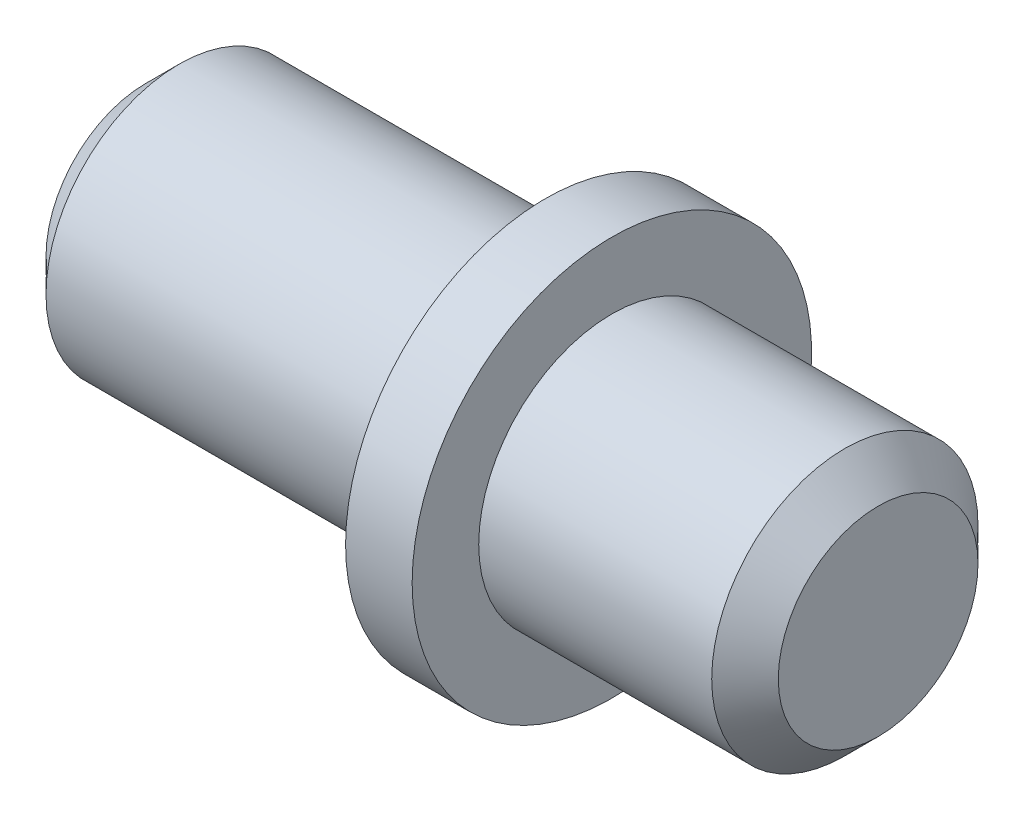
from build123d import *

# Parameters (mm, degrees)
CHANFREIN1_SIZE = 0.5


with BuildPart() as part:
    # Esquisse1 → R_volution1 (revolve)
    with BuildSketch(Plane.XY, mode=Mode.PRIVATE) as r_volution1_sk:
        Polygon((0, 0), (0, 2), (-4, 2), (-4, 3), (-5, 3), (-5, 2), (-11, 2), (-11, 0), align=None)
    revolve(r_volution1_sk.sketch.rotate(Axis((0, 0, 0), (1, 0, 0)), 90), axis=Axis((0, 0, 0), (1, 0, 0)))

    # Chanfrein1
    chanfrein1_edges = [part.edges().sort_by_distance(p)[0] for p in [
        (-11, 0, -2),
        (0, 0, -2),
    ]]
    chamfer(chanfrein1_edges, length=CHANFREIN1_SIZE)


solid = part.part
